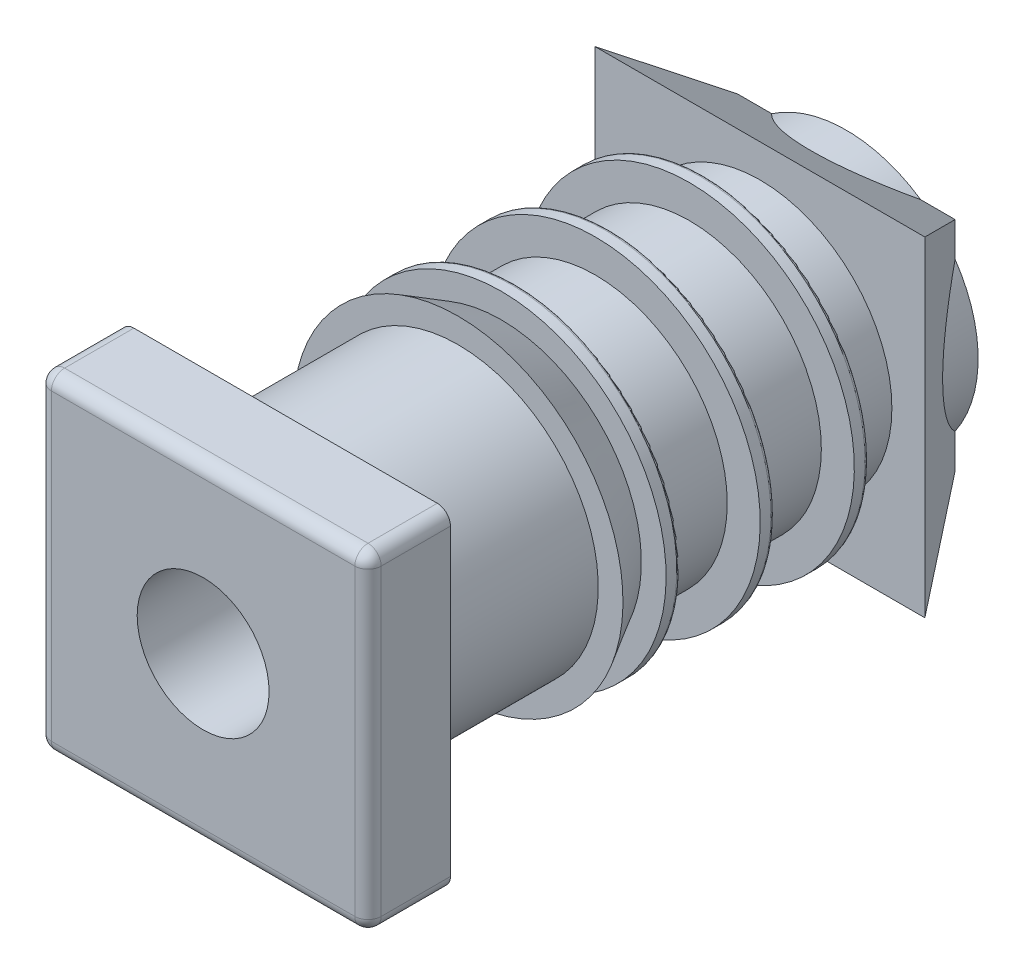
ISO-10303-21;
HEADER;
FILE_DESCRIPTION(('STEP AP214'),'2;1');
FILE_NAME('part.step','',(''),(''),'','','');
FILE_SCHEMA(('AUTOMOTIVE_DESIGN { 1 0 10303 214 1 1 1 1 }'));
ENDSEC;
DATA;
#1=APPLICATION_CONTEXT('core data for automotive mechanical design processes');
#2=APPLICATION_PROTOCOL_DEFINITION('international standard','automotive_design',2000,#1);
#3=PRODUCT_CONTEXT('',#1,'mechanical');
#4=PRODUCT('Part','Part','',(#3));
#5=PRODUCT_RELATED_PRODUCT_CATEGORY('part','',(#4));
#6=PRODUCT_DEFINITION_FORMATION('','',#4);
#7=PRODUCT_DEFINITION_CONTEXT('part definition',#1,'design');
#8=PRODUCT_DEFINITION('design','',#6,#7);
#9=PRODUCT_DEFINITION_SHAPE('','',#8);
#10=(LENGTH_UNIT() NAMED_UNIT(*) SI_UNIT(.MILLI.,.METRE.));
#11=(NAMED_UNIT(*) PLANE_ANGLE_UNIT() SI_UNIT($,.RADIAN.));
#12=(NAMED_UNIT(*) SI_UNIT($,.STERADIAN.) SOLID_ANGLE_UNIT());
#13=UNCERTAINTY_MEASURE_WITH_UNIT(LENGTH_MEASURE(1.E-05),#10,'distance_accuracy_value','');
#14=(GEOMETRIC_REPRESENTATION_CONTEXT(3) GLOBAL_UNCERTAINTY_ASSIGNED_CONTEXT((#13)) GLOBAL_UNIT_ASSIGNED_CONTEXT((#10,
#11,#12)) REPRESENTATION_CONTEXT('',''));
#15=CARTESIAN_POINT('',(0.,0.,0.));
#16=DIRECTION('',(0.,0.,1.));
#17=DIRECTION('',(1.,0.,0.));
#18=AXIS2_PLACEMENT_3D('',#15,#16,#17);
#19=CARTESIAN_POINT('',(-8.9,0.,-13.9269230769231));
#20=DIRECTION('',(0.,0.,-1.));
#21=DIRECTION('',(0.,-1.,0.));
#22=AXIS2_PLACEMENT_3D('',#19,#20,#21);
#23=PLANE('',#22);
#24=CARTESIAN_POINT('',(0.,0.,-13.9269230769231));
#25=DIRECTION('',(0.,0.,1.));
#26=DIRECTION('',(0.,-1.,0.));
#27=AXIS2_PLACEMENT_3D('',#24,#25,#26);
#28=CIRCLE('',#27,9.8);
#29=CARTESIAN_POINT('',(0.,-9.8,-13.9269230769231));
#30=VERTEX_POINT('',#29);
#31=CARTESIAN_POINT('',(0.,9.8,-13.9269230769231));
#32=VERTEX_POINT('',#31);
#33=EDGE_CURVE('E337',#30,#32,#28,.T.);
#34=ORIENTED_EDGE('',*,*,#33,.F.);
#35=CARTESIAN_POINT('',(0.,0.,-13.9269230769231));
#36=DIRECTION('',(0.,0.,1.));
#37=DIRECTION('',(-1.,0.,0.));
#38=AXIS2_PLACEMENT_3D('',#35,#36,#37);
#39=CIRCLE('',#38,9.8);
#40=CARTESIAN_POINT('',(-9.8,0.,-13.9269230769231));
#41=VERTEX_POINT('',#40);
#42=EDGE_CURVE('E347',#41,#30,#39,.T.);
#43=ORIENTED_EDGE('',*,*,#42,.F.);
#44=CARTESIAN_POINT('',(0.,0.,-13.9269230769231));
#45=DIRECTION('',(0.,0.,1.));
#46=DIRECTION('',(0.,1.,0.));
#47=AXIS2_PLACEMENT_3D('',#44,#45,#46);
#48=CIRCLE('',#47,9.8);
#49=EDGE_CURVE('E296',#32,#41,#48,.T.);
#50=ORIENTED_EDGE('',*,*,#49,.F.);
#51=EDGE_LOOP('',(#34,#43,#50));
#52=FACE_BOUND('',#51,.T.);
#53=CARTESIAN_POINT('',(0.,0.,-13.9269230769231));
#54=DIRECTION('',(0.,0.,1.));
#55=DIRECTION('',(0.,1.,0.));
#56=AXIS2_PLACEMENT_3D('',#53,#54,#55);
#57=CIRCLE('',#56,8.);
#58=CARTESIAN_POINT('',(0.,8.,-13.9269230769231));
#59=VERTEX_POINT('',#58);
#60=EDGE_CURVE('E435',#59,#59,#57,.F.);
#61=ORIENTED_EDGE('',*,*,#60,.F.);
#62=EDGE_LOOP('',(#61));
#63=FACE_BOUND('',#62,.T.);
#64=ADVANCED_FACE('F14',(#52,#63),#23,.T.);
#65=CARTESIAN_POINT('',(0.,0.,-13.7269230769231));
#66=DIRECTION('',(0.,0.,-1.));
#67=DIRECTION('',(0.,-1.,0.));
#68=AXIS2_PLACEMENT_3D('',#65,#66,#67);
#69=TOROIDAL_SURFACE('',#68,9.8,0.2);
#70=ORIENTED_EDGE('',*,*,#42,.T.);
#71=ORIENTED_EDGE('',*,*,#33,.T.);
#72=ORIENTED_EDGE('',*,*,#49,.T.);
#73=EDGE_LOOP('',(#70,#71,#72));
#74=FACE_BOUND('',#73,.T.);
#75=CARTESIAN_POINT('',(0.,0.,-13.7269230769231));
#76=DIRECTION('',(0.,0.,1.));
#77=DIRECTION('',(0.,1.,0.));
#78=AXIS2_PLACEMENT_3D('',#75,#76,#77);
#79=CIRCLE('',#78,10.);
#80=CARTESIAN_POINT('',(0.,10.,-13.7269230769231));
#81=VERTEX_POINT('',#80);
#82=EDGE_CURVE('E323',#81,#81,#79,.T.);
#83=ORIENTED_EDGE('',*,*,#82,.F.);
#84=EDGE_LOOP('',(#83));
#85=FACE_BOUND('',#84,.T.);
#86=ADVANCED_FACE('F303',(#74,#85),#69,.T.);
#87=CARTESIAN_POINT('',(0.,0.,-16.3554945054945));
#88=DIRECTION('',(0.,0.,1.));
#89=DIRECTION('',(0.,1.,0.));
#90=AXIS2_PLACEMENT_3D('',#87,#88,#89);
#91=CYLINDRICAL_SURFACE('',#90,8.);
#92=CARTESIAN_POINT('',(0.,0.,-18.7840659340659));
#93=DIRECTION('',(0.,0.,1.));
#94=DIRECTION('',(0.,1.,0.));
#95=AXIS2_PLACEMENT_3D('',#92,#93,#94);
#96=CIRCLE('',#95,8.);
#97=CARTESIAN_POINT('',(0.,8.,-18.7840659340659));
#98=VERTEX_POINT('',#97);
#99=EDGE_CURVE('E432',#98,#98,#96,.F.);
#100=ORIENTED_EDGE('',*,*,#99,.F.);
#101=EDGE_LOOP('',(#100));
#102=FACE_BOUND('',#101,.T.);
#103=ORIENTED_EDGE('',*,*,#60,.T.);
#104=EDGE_LOOP('',(#103));
#105=FACE_BOUND('',#104,.T.);
#106=ADVANCED_FACE('F314',(#102,#105),#91,.T.);
#107=CARTESIAN_POINT('',(0.,0.,-13.4019230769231));
#108=DIRECTION('',(0.,0.,1.));
#109=DIRECTION('',(0.,1.,0.));
#110=AXIS2_PLACEMENT_3D('',#107,#108,#109);
#111=CYLINDRICAL_SURFACE('',#110,10.);
#112=ORIENTED_EDGE('',*,*,#82,.T.);
#113=EDGE_LOOP('',(#112));
#114=FACE_BOUND('',#113,.T.);
#115=CARTESIAN_POINT('',(0.,0.,-13.0769230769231));
#116=DIRECTION('',(0.,0.,1.));
#117=DIRECTION('',(0.,1.,0.));
#118=AXIS2_PLACEMENT_3D('',#115,#116,#117);
#119=CIRCLE('',#118,10.);
#120=CARTESIAN_POINT('',(0.,10.,-13.0769230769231));
#121=VERTEX_POINT('',#120);
#122=EDGE_CURVE('E429',#121,#121,#119,.T.);
#123=ORIENTED_EDGE('',*,*,#122,.F.);
#124=EDGE_LOOP('',(#123));
#125=FACE_BOUND('',#124,.T.);
#126=ADVANCED_FACE('F1013',(#114,#125),#111,.T.);
#127=CARTESIAN_POINT('',(-9.,0.,-18.7840659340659));
#128=DIRECTION('',(0.,0.,1.));
#129=DIRECTION('',(0.,1.,0.));
#130=AXIS2_PLACEMENT_3D('',#127,#128,#129);
#131=PLANE('',#130);
#132=ORIENTED_EDGE('',*,*,#99,.T.);
#133=EDGE_LOOP('',(#132));
#134=FACE_BOUND('',#133,.T.);
#135=CARTESIAN_POINT('',(0.,0.,-18.7840659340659));
#136=DIRECTION('',(0.,0.,1.));
#137=DIRECTION('',(0.,1.,0.));
#138=AXIS2_PLACEMENT_3D('',#135,#136,#137);
#139=CIRCLE('',#138,10.);
#140=CARTESIAN_POINT('',(0.,10.,-18.7840659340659));
#141=VERTEX_POINT('',#140);
#142=EDGE_CURVE('E426',#141,#141,#139,.F.);
#143=ORIENTED_EDGE('',*,*,#142,.F.);
#144=EDGE_LOOP('',(#143));
#145=FACE_BOUND('',#144,.T.);
#146=ADVANCED_FACE('F1003',(#134,#145),#131,.T.);
#147=CARTESIAN_POINT('',(-9.25,0.,-13.0769230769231));
#148=DIRECTION('',(0.,0.,1.));
#149=DIRECTION('',(0.,1.,0.));
#150=AXIS2_PLACEMENT_3D('',#147,#148,#149);
#151=PLANE('',#150);
#152=CARTESIAN_POINT('',(0.,0.,-13.0769230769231));
#153=DIRECTION('',(0.,0.,1.));
#154=DIRECTION('',(0.,1.,0.));
#155=AXIS2_PLACEMENT_3D('',#152,#153,#154);
#156=CIRCLE('',#155,8.5);
#157=CARTESIAN_POINT('',(0.,8.5,-13.0769230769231));
#158=VERTEX_POINT('',#157);
#159=EDGE_CURVE('E423',#158,#158,#156,.T.);
#160=ORIENTED_EDGE('',*,*,#159,.F.);
#161=EDGE_LOOP('',(#160));
#162=FACE_BOUND('',#161,.T.);
#163=ORIENTED_EDGE('',*,*,#122,.T.);
#164=EDGE_LOOP('',(#163));
#165=FACE_BOUND('',#164,.T.);
#166=ADVANCED_FACE('F994',(#162,#165),#151,.T.);
#167=CARTESIAN_POINT('',(0.,0.,-19.1090659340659));
#168=DIRECTION('',(0.,0.,1.));
#169=DIRECTION('',(0.,1.,0.));
#170=AXIS2_PLACEMENT_3D('',#167,#168,#169);
#171=CYLINDRICAL_SURFACE('',#170,10.);
#172=ORIENTED_EDGE('',*,*,#142,.T.);
#173=EDGE_LOOP('',(#172));
#174=FACE_BOUND('',#173,.T.);
#175=CARTESIAN_POINT('',(0.,0.,-19.4340659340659));
#176=DIRECTION('',(0.,0.,-1.));
#177=DIRECTION('',(0.,-1.,0.));
#178=AXIS2_PLACEMENT_3D('',#175,#176,#177);
#179=CIRCLE('',#178,10.);
#180=CARTESIAN_POINT('',(0.,-10.,-19.4340659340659));
#181=VERTEX_POINT('',#180);
#182=EDGE_CURVE('E263',#181,#181,#179,.T.);
#183=ORIENTED_EDGE('',*,*,#182,.F.);
#184=EDGE_LOOP('',(#183));
#185=FACE_BOUND('',#184,.T.);
#186=ADVANCED_FACE('F985',(#174,#185),#171,.T.);
#187=CARTESIAN_POINT('',(0.,0.,-10.4615384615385));
#188=DIRECTION('',(0.,0.,1.));
#189=DIRECTION('',(0.,1.,0.));
#190=AXIS2_PLACEMENT_3D('',#187,#188,#189);
#191=CONICAL_SURFACE('',#190,10.,0.520728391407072);
#192=ORIENTED_EDGE('',*,*,#159,.T.);
#193=EDGE_LOOP('',(#192));
#194=FACE_BOUND('',#193,.T.);
#195=CARTESIAN_POINT('',(0.,0.,-10.4615384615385));
#196=DIRECTION('',(0.,0.,1.));
#197=DIRECTION('',(0.,1.,0.));
#198=AXIS2_PLACEMENT_3D('',#195,#196,#197);
#199=CIRCLE('',#198,10.);
#200=CARTESIAN_POINT('',(0.,10.,-10.4615384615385));
#201=VERTEX_POINT('',#200);
#202=EDGE_CURVE('E255',#201,#201,#199,.T.);
#203=ORIENTED_EDGE('',*,*,#202,.F.);
#204=EDGE_LOOP('',(#203));
#205=FACE_BOUND('',#204,.T.);
#206=ADVANCED_FACE('F273',(#194,#205),#191,.T.);
#207=CARTESIAN_POINT('',(0.,0.,-19.4340659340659));
#208=DIRECTION('',(0.,0.,-1.));
#209=DIRECTION('',(0.,-1.,0.));
#210=AXIS2_PLACEMENT_3D('',#207,#208,#209);
#211=TOROIDAL_SURFACE('',#210,9.8,0.2);
#212=ORIENTED_EDGE('',*,*,#182,.T.);
#213=EDGE_LOOP('',(#212));
#214=FACE_BOUND('',#213,.T.);
#215=CARTESIAN_POINT('',(0.,0.,-19.6340659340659));
#216=DIRECTION('',(0.,0.,1.));
#217=DIRECTION('',(0.,1.,0.));
#218=AXIS2_PLACEMENT_3D('',#215,#216,#217);
#219=CIRCLE('',#218,9.8);
#220=CARTESIAN_POINT('',(-9.8,0.,-19.6340659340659));
#221=VERTEX_POINT('',#220);
#222=CARTESIAN_POINT('',(0.,9.8,-19.6340659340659));
#223=VERTEX_POINT('',#222);
#224=EDGE_CURVE('E207',#221,#223,#219,.F.);
#225=ORIENTED_EDGE('',*,*,#224,.F.);
#226=CARTESIAN_POINT('',(0.,0.,-19.6340659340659));
#227=DIRECTION('',(0.,0.,1.));
#228=DIRECTION('',(-1.,0.,0.));
#229=AXIS2_PLACEMENT_3D('',#226,#227,#228);
#230=CIRCLE('',#229,9.8);
#231=CARTESIAN_POINT('',(0.,-9.8,-19.6340659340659));
#232=VERTEX_POINT('',#231);
#233=EDGE_CURVE('E244',#232,#221,#230,.F.);
#234=ORIENTED_EDGE('',*,*,#233,.F.);
#235=CARTESIAN_POINT('',(0.,0.,-19.6340659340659));
#236=DIRECTION('',(0.,0.,1.));
#237=DIRECTION('',(0.,-1.,0.));
#238=AXIS2_PLACEMENT_3D('',#235,#236,#237);
#239=CIRCLE('',#238,9.8);
#240=EDGE_CURVE('E246',#223,#232,#239,.F.);
#241=ORIENTED_EDGE('',*,*,#240,.F.);
#242=EDGE_LOOP('',(#225,#234,#241));
#243=FACE_BOUND('',#242,.T.);
#244=ADVANCED_FACE('F253',(#214,#243),#211,.T.);
#245=CARTESIAN_POINT('',(-9.25,0.,-10.4615384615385));
#246=DIRECTION('',(0.,0.,1.));
#247=DIRECTION('',(0.,1.,0.));
#248=AXIS2_PLACEMENT_3D('',#245,#246,#247);
#249=PLANE('',#248);
#250=CARTESIAN_POINT('',(0.,0.,-10.4615384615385));
#251=DIRECTION('',(0.,0.,1.));
#252=DIRECTION('',(0.,1.,0.));
#253=AXIS2_PLACEMENT_3D('',#250,#251,#252);
#254=CIRCLE('',#253,8.5);
#255=CARTESIAN_POINT('',(0.,8.5,-10.4615384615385));
#256=VERTEX_POINT('',#255);
#257=EDGE_CURVE('E251',#256,#256,#254,.T.);
#258=ORIENTED_EDGE('',*,*,#257,.F.);
#259=EDGE_LOOP('',(#258));
#260=FACE_BOUND('',#259,.T.);
#261=ORIENTED_EDGE('',*,*,#202,.T.);
#262=EDGE_LOOP('',(#261));
#263=FACE_BOUND('',#262,.T.);
#264=ADVANCED_FACE('F225',(#260,#263),#249,.T.);
#265=CARTESIAN_POINT('',(-8.9,0.,-19.6340659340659));
#266=DIRECTION('',(0.,0.,-1.));
#267=DIRECTION('',(0.,-1.,0.));
#268=AXIS2_PLACEMENT_3D('',#265,#266,#267);
#269=PLANE('',#268);
#270=ORIENTED_EDGE('',*,*,#240,.T.);
#271=ORIENTED_EDGE('',*,*,#233,.T.);
#272=ORIENTED_EDGE('',*,*,#224,.T.);
#273=EDGE_LOOP('',(#270,#271,#272));
#274=FACE_BOUND('',#273,.T.);
#275=CARTESIAN_POINT('',(0.,0.,-19.6340659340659));
#276=DIRECTION('',(0.,0.,1.));
#277=DIRECTION('',(0.,1.,0.));
#278=AXIS2_PLACEMENT_3D('',#275,#276,#277);
#279=CIRCLE('',#278,8.);
#280=CARTESIAN_POINT('',(0.,8.,-19.6340659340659));
#281=VERTEX_POINT('',#280);
#282=EDGE_CURVE('E416',#281,#281,#279,.F.);
#283=ORIENTED_EDGE('',*,*,#282,.F.);
#284=EDGE_LOOP('',(#283));
#285=FACE_BOUND('',#284,.T.);
#286=ADVANCED_FACE('F214',(#274,#285),#269,.T.);
#287=CARTESIAN_POINT('',(0.,0.,-2.73076923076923));
#288=DIRECTION('',(0.,0.,1.));
#289=DIRECTION('',(0.,1.,0.));
#290=AXIS2_PLACEMENT_3D('',#287,#288,#289);
#291=CYLINDRICAL_SURFACE('',#290,8.5);
#292=CARTESIAN_POINT('',(0.,0.,0.));
#293=DIRECTION('',(0.,0.,1.));
#294=DIRECTION('',(0.,1.,0.));
#295=AXIS2_PLACEMENT_3D('',#292,#293,#294);
#296=CIRCLE('',#295,8.5);
#297=CARTESIAN_POINT('',(0.,8.5,0.));
#298=VERTEX_POINT('',#297);
#299=EDGE_CURVE('E407',#298,#298,#296,.T.);
#300=ORIENTED_EDGE('',*,*,#299,.F.);
#301=EDGE_LOOP('',(#300));
#302=FACE_BOUND('',#301,.T.);
#303=ORIENTED_EDGE('',*,*,#257,.T.);
#304=EDGE_LOOP('',(#303));
#305=FACE_BOUND('',#304,.T.);
#306=ADVANCED_FACE('F224',(#302,#305),#291,.T.);
#307=CARTESIAN_POINT('',(0.,0.,-22.0626373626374));
#308=DIRECTION('',(0.,0.,1.));
#309=DIRECTION('',(0.,1.,0.));
#310=AXIS2_PLACEMENT_3D('',#307,#308,#309);
#311=CYLINDRICAL_SURFACE('',#310,8.);
#312=CARTESIAN_POINT('',(0.,0.,-24.4912087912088));
#313=DIRECTION('',(0.,0.,1.));
#314=DIRECTION('',(0.,1.,0.));
#315=AXIS2_PLACEMENT_3D('',#312,#313,#314);
#316=CIRCLE('',#315,8.);
#317=CARTESIAN_POINT('',(0.,8.,-24.4912087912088));
#318=VERTEX_POINT('',#317);
#319=EDGE_CURVE('E192',#318,#318,#316,.F.);
#320=ORIENTED_EDGE('',*,*,#319,.F.);
#321=EDGE_LOOP('',(#320));
#322=FACE_BOUND('',#321,.T.);
#323=ORIENTED_EDGE('',*,*,#282,.T.);
#324=EDGE_LOOP('',(#323));
#325=FACE_BOUND('',#324,.T.);
#326=ADVANCED_FACE('F883',(#322,#325),#311,.T.);
#327=CARTESIAN_POINT('',(9.2,-9.2,5.));
#328=DIRECTION('',(0.,0.,1.));
#329=DIRECTION('',(0.,1.,0.));
#330=AXIS2_PLACEMENT_3D('',#327,#328,#329);
#331=CYLINDRICAL_SURFACE('',#330,0.8);
#332=DIRECTION('',(0.,0.,-1.));
#333=VECTOR('',#332,1.);
#334=CARTESIAN_POINT('',(10.,-9.2,5.));
#335=LINE('',#334,#333);
#336=CARTESIAN_POINT('',(10.,-9.2,4.2));
#337=VERTEX_POINT('',#336);
#338=CARTESIAN_POINT('',(10.,-9.2,0.));
#339=VERTEX_POINT('',#338);
#340=EDGE_CURVE('E143',#337,#339,#335,.T.);
#341=ORIENTED_EDGE('',*,*,#340,.F.);
#342=CARTESIAN_POINT('',(9.2,-9.2,4.2));
#343=DIRECTION('',(0.,0.,1.));
#344=DIRECTION('',(1.,0.,0.));
#345=AXIS2_PLACEMENT_3D('',#342,#343,#344);
#346=CIRCLE('',#345,0.8);
#347=CARTESIAN_POINT('',(9.2,-10.,4.2));
#348=VERTEX_POINT('',#347);
#349=EDGE_CURVE('E129',#337,#348,#346,.F.);
#350=ORIENTED_EDGE('',*,*,#349,.T.);
#351=DIRECTION('',(0.,0.,-1.));
#352=VECTOR('',#351,1.);
#353=CARTESIAN_POINT('',(9.2,-10.,5.));
#354=LINE('',#353,#352);
#355=CARTESIAN_POINT('',(9.2,-10.,0.));
#356=VERTEX_POINT('',#355);
#357=EDGE_CURVE('E142',#356,#348,#354,.F.);
#358=ORIENTED_EDGE('',*,*,#357,.F.);
#359=CARTESIAN_POINT('',(9.2,-9.2,0.));
#360=DIRECTION('',(0.,0.,1.));
#361=DIRECTION('',(0.,1.,0.));
#362=AXIS2_PLACEMENT_3D('',#359,#360,#361);
#363=CIRCLE('',#362,0.8);
#364=EDGE_CURVE('E412',#339,#356,#363,.F.);
#365=ORIENTED_EDGE('',*,*,#364,.F.);
#366=EDGE_LOOP('',(#341,#350,#358,#365));
#367=FACE_BOUND('',#366,.T.);
#368=ADVANCED_FACE('F140',(#367),#331,.T.);
#369=CARTESIAN_POINT('',(9.2,9.2,5.));
#370=DIRECTION('',(0.,0.,1.));
#371=DIRECTION('',(0.,1.,0.));
#372=AXIS2_PLACEMENT_3D('',#369,#370,#371);
#373=CYLINDRICAL_SURFACE('',#372,0.8);
#374=DIRECTION('',(0.,0.,-1.));
#375=VECTOR('',#374,1.);
#376=CARTESIAN_POINT('',(9.2,10.,5.));
#377=LINE('',#376,#375);
#378=CARTESIAN_POINT('',(9.2,10.,4.2));
#379=VERTEX_POINT('',#378);
#380=CARTESIAN_POINT('',(9.2,10.,0.));
#381=VERTEX_POINT('',#380);
#382=EDGE_CURVE('E181',#379,#381,#377,.T.);
#383=ORIENTED_EDGE('',*,*,#382,.F.);
#384=CARTESIAN_POINT('',(9.2,9.2,4.2));
#385=DIRECTION('',(0.,0.,1.));
#386=DIRECTION('',(1.,0.,0.));
#387=AXIS2_PLACEMENT_3D('',#384,#385,#386);
#388=CIRCLE('',#387,0.8);
#389=CARTESIAN_POINT('',(10.,9.2,4.2));
#390=VERTEX_POINT('',#389);
#391=EDGE_CURVE('E9',#379,#390,#388,.F.);
#392=ORIENTED_EDGE('',*,*,#391,.T.);
#393=DIRECTION('',(0.,0.,-1.));
#394=VECTOR('',#393,1.);
#395=CARTESIAN_POINT('',(10.,9.2,5.));
#396=LINE('',#395,#394);
#397=CARTESIAN_POINT('',(10.,9.2,0.));
#398=VERTEX_POINT('',#397);
#399=EDGE_CURVE('E184',#398,#390,#396,.F.);
#400=ORIENTED_EDGE('',*,*,#399,.F.);
#401=CARTESIAN_POINT('',(9.2,9.2,0.));
#402=DIRECTION('',(0.,0.,1.));
#403=DIRECTION('',(0.,1.,0.));
#404=AXIS2_PLACEMENT_3D('',#401,#402,#403);
#405=CIRCLE('',#404,0.8);
#406=EDGE_CURVE('E414',#381,#398,#405,.F.);
#407=ORIENTED_EDGE('',*,*,#406,.F.);
#408=EDGE_LOOP('',(#383,#392,#400,#407));
#409=FACE_BOUND('',#408,.T.);
#410=ADVANCED_FACE('F545',(#409),#373,.T.);
#411=CARTESIAN_POINT('',(-9.2,9.2,5.));
#412=DIRECTION('',(0.,0.,1.));
#413=DIRECTION('',(0.,1.,0.));
#414=AXIS2_PLACEMENT_3D('',#411,#412,#413);
#415=CYLINDRICAL_SURFACE('',#414,0.8);
#416=DIRECTION('',(0.,0.,-1.));
#417=VECTOR('',#416,1.);
#418=CARTESIAN_POINT('',(-10.,9.2,5.));
#419=LINE('',#418,#417);
#420=CARTESIAN_POINT('',(-10.,9.2,4.2));
#421=VERTEX_POINT('',#420);
#422=CARTESIAN_POINT('',(-10.,9.2,0.));
#423=VERTEX_POINT('',#422);
#424=EDGE_CURVE('E175',#421,#423,#419,.T.);
#425=ORIENTED_EDGE('',*,*,#424,.F.);
#426=CARTESIAN_POINT('',(-9.2,9.2,4.2));
#427=DIRECTION('',(0.,0.,1.));
#428=DIRECTION('',(1.,0.,0.));
#429=AXIS2_PLACEMENT_3D('',#426,#427,#428);
#430=CIRCLE('',#429,0.8);
#431=CARTESIAN_POINT('',(-9.2,10.,4.2));
#432=VERTEX_POINT('',#431);
#433=EDGE_CURVE('E517',#421,#432,#430,.F.);
#434=ORIENTED_EDGE('',*,*,#433,.T.);
#435=DIRECTION('',(0.,0.,-1.));
#436=VECTOR('',#435,1.);
#437=CARTESIAN_POINT('',(-9.2,10.,5.));
#438=LINE('',#437,#436);
#439=CARTESIAN_POINT('',(-9.2,10.,0.));
#440=VERTEX_POINT('',#439);
#441=EDGE_CURVE('E178',#440,#432,#438,.F.);
#442=ORIENTED_EDGE('',*,*,#441,.F.);
#443=CARTESIAN_POINT('',(-9.2,9.2,0.));
#444=DIRECTION('',(0.,0.,1.));
#445=DIRECTION('',(0.,1.,0.));
#446=AXIS2_PLACEMENT_3D('',#443,#444,#445);
#447=CIRCLE('',#446,0.8);
#448=EDGE_CURVE('E410',#423,#440,#447,.F.);
#449=ORIENTED_EDGE('',*,*,#448,.F.);
#450=EDGE_LOOP('',(#425,#434,#442,#449));
#451=FACE_BOUND('',#450,.T.);
#452=ADVANCED_FACE('F554',(#451),#415,.T.);
#453=CARTESIAN_POINT('',(0.,0.,0.));
#454=DIRECTION('',(0.,0.,-1.));
#455=DIRECTION('',(0.,-1.,0.));
#456=AXIS2_PLACEMENT_3D('',#453,#454,#455);
#457=PLANE('',#456);
#458=ORIENTED_EDGE('',*,*,#299,.T.);
#459=EDGE_LOOP('',(#458));
#460=FACE_BOUND('',#459,.T.);
#461=ORIENTED_EDGE('',*,*,#448,.T.);
#462=DIRECTION('',(1.,0.,0.));
#463=VECTOR('',#462,1.);
#464=CARTESIAN_POINT('',(9.2,10.,0.));
#465=LINE('',#464,#463);
#466=EDGE_CURVE('E183',#381,#440,#465,.F.);
#467=ORIENTED_EDGE('',*,*,#466,.F.);
#468=ORIENTED_EDGE('',*,*,#406,.T.);
#469=DIRECTION('',(0.,-1.,0.));
#470=VECTOR('',#469,1.);
#471=CARTESIAN_POINT('',(10.,-9.2,0.));
#472=LINE('',#471,#470);
#473=EDGE_CURVE('E188',#339,#398,#472,.F.);
#474=ORIENTED_EDGE('',*,*,#473,.F.);
#475=ORIENTED_EDGE('',*,*,#364,.T.);
#476=DIRECTION('',(-1.,0.,0.));
#477=VECTOR('',#476,1.);
#478=CARTESIAN_POINT('',(-9.2,-10.,0.));
#479=LINE('',#478,#477);
#480=CARTESIAN_POINT('',(-9.2,-10.,0.));
#481=VERTEX_POINT('',#480);
#482=EDGE_CURVE('E155',#481,#356,#479,.F.);
#483=ORIENTED_EDGE('',*,*,#482,.F.);
#484=CARTESIAN_POINT('',(-9.2,-9.2,0.));
#485=DIRECTION('',(0.,0.,1.));
#486=DIRECTION('',(0.,1.,0.));
#487=AXIS2_PLACEMENT_3D('',#484,#485,#486);
#488=CIRCLE('',#487,0.8);
#489=CARTESIAN_POINT('',(-10.,-9.2,0.));
#490=VERTEX_POINT('',#489);
#491=EDGE_CURVE('E405',#490,#481,#488,.T.);
#492=ORIENTED_EDGE('',*,*,#491,.F.);
#493=DIRECTION('',(0.,1.,0.));
#494=VECTOR('',#493,1.);
#495=CARTESIAN_POINT('',(-10.,9.2,0.));
#496=LINE('',#495,#494);
#497=EDGE_CURVE('E177',#423,#490,#496,.F.);
#498=ORIENTED_EDGE('',*,*,#497,.F.);
#499=EDGE_LOOP('',(#461,#467,#468,#474,#475,#483,#492,#498));
#500=FACE_BOUND('',#499,.T.);
#501=ADVANCED_FACE('F571',(#460,#500),#457,.T.);
#502=CARTESIAN_POINT('',(-9.2,-9.2,5.));
#503=DIRECTION('',(0.,0.,1.));
#504=DIRECTION('',(0.,1.,0.));
#505=AXIS2_PLACEMENT_3D('',#502,#503,#504);
#506=CYLINDRICAL_SURFACE('',#505,0.8);
#507=DIRECTION('',(0.,0.,-1.));
#508=VECTOR('',#507,1.);
#509=CARTESIAN_POINT('',(-9.2,-10.,5.));
#510=LINE('',#509,#508);
#511=CARTESIAN_POINT('',(-9.2,-10.,4.2));
#512=VERTEX_POINT('',#511);
#513=EDGE_CURVE('E191',#512,#481,#510,.T.);
#514=ORIENTED_EDGE('',*,*,#513,.F.);
#515=CARTESIAN_POINT('',(-9.2,-9.2,4.2));
#516=DIRECTION('',(0.,0.,1.));
#517=DIRECTION('',(1.,0.,0.));
#518=AXIS2_PLACEMENT_3D('',#515,#516,#517);
#519=CIRCLE('',#518,0.8);
#520=CARTESIAN_POINT('',(-10.,-9.2,4.2));
#521=VERTEX_POINT('',#520);
#522=EDGE_CURVE('E526',#512,#521,#519,.F.);
#523=ORIENTED_EDGE('',*,*,#522,.T.);
#524=DIRECTION('',(0.,0.,-1.));
#525=VECTOR('',#524,1.);
#526=CARTESIAN_POINT('',(-10.,-9.2,5.));
#527=LINE('',#526,#525);
#528=EDGE_CURVE('E166',#490,#521,#527,.F.);
#529=ORIENTED_EDGE('',*,*,#528,.F.);
#530=ORIENTED_EDGE('',*,*,#491,.T.);
#531=EDGE_LOOP('',(#514,#523,#529,#530));
#532=FACE_BOUND('',#531,.T.);
#533=ADVANCED_FACE('F566',(#532),#506,.T.);
#534=CARTESIAN_POINT('',(-9.,0.,-24.4912087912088));
#535=DIRECTION('',(0.,0.,1.));
#536=DIRECTION('',(0.,1.,0.));
#537=AXIS2_PLACEMENT_3D('',#534,#535,#536);
#538=PLANE('',#537);
#539=ORIENTED_EDGE('',*,*,#319,.T.);
#540=EDGE_LOOP('',(#539));
#541=FACE_BOUND('',#540,.T.);
#542=CARTESIAN_POINT('',(0.,0.,-24.4912087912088));
#543=DIRECTION('',(0.,0.,1.));
#544=DIRECTION('',(0.,1.,0.));
#545=AXIS2_PLACEMENT_3D('',#542,#543,#544);
#546=CIRCLE('',#545,10.);
#547=CARTESIAN_POINT('',(0.,10.,-24.4912087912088));
#548=VERTEX_POINT('',#547);
#549=EDGE_CURVE('E161',#548,#548,#546,.F.);
#550=ORIENTED_EDGE('',*,*,#549,.F.);
#551=EDGE_LOOP('',(#550));
#552=FACE_BOUND('',#551,.T.);
#553=ADVANCED_FACE('F581',(#541,#552),#538,.T.);
#554=CARTESIAN_POINT('',(-9.2,-10.,5.));
#555=DIRECTION('',(0.,-1.,0.));
#556=DIRECTION('',(-1.,0.,0.));
#557=AXIS2_PLACEMENT_3D('',#554,#555,#556);
#558=PLANE('',#557);
#559=ORIENTED_EDGE('',*,*,#482,.T.);
#560=ORIENTED_EDGE('',*,*,#357,.T.);
#561=DIRECTION('',(-1.,0.,0.));
#562=VECTOR('',#561,1.);
#563=CARTESIAN_POINT('',(-20.,-10.,4.2));
#564=LINE('',#563,#562);
#565=EDGE_CURVE('E152',#512,#348,#564,.F.);
#566=ORIENTED_EDGE('',*,*,#565,.F.);
#567=ORIENTED_EDGE('',*,*,#513,.T.);
#568=EDGE_LOOP('',(#559,#560,#566,#567));
#569=FACE_BOUND('',#568,.T.);
#570=ADVANCED_FACE('F150',(#569),#558,.T.);
#571=CARTESIAN_POINT('',(10.,-9.2,5.));
#572=DIRECTION('',(1.,0.,0.));
#573=DIRECTION('',(0.,-1.,0.));
#574=AXIS2_PLACEMENT_3D('',#571,#572,#573);
#575=PLANE('',#574);
#576=ORIENTED_EDGE('',*,*,#473,.T.);
#577=ORIENTED_EDGE('',*,*,#399,.T.);
#578=DIRECTION('',(0.,-1.,0.));
#579=VECTOR('',#578,1.);
#580=CARTESIAN_POINT('',(10.,-20.,4.2));
#581=LINE('',#580,#579);
#582=EDGE_CURVE('E160',#337,#390,#581,.F.);
#583=ORIENTED_EDGE('',*,*,#582,.F.);
#584=ORIENTED_EDGE('',*,*,#340,.T.);
#585=EDGE_LOOP('',(#576,#577,#583,#584));
#586=FACE_BOUND('',#585,.T.);
#587=ADVANCED_FACE('F540',(#586),#575,.T.);
#588=CARTESIAN_POINT('',(9.2,10.,5.));
#589=DIRECTION('',(0.,1.,0.));
#590=DIRECTION('',(1.,0.,0.));
#591=AXIS2_PLACEMENT_3D('',#588,#589,#590);
#592=PLANE('',#591);
#593=ORIENTED_EDGE('',*,*,#466,.T.);
#594=ORIENTED_EDGE('',*,*,#441,.T.);
#595=DIRECTION('',(-1.,0.,0.));
#596=VECTOR('',#595,1.);
#597=CARTESIAN_POINT('',(-20.,10.,4.2));
#598=LINE('',#597,#596);
#599=EDGE_CURVE('E163',#379,#432,#598,.T.);
#600=ORIENTED_EDGE('',*,*,#599,.F.);
#601=ORIENTED_EDGE('',*,*,#382,.T.);
#602=EDGE_LOOP('',(#593,#594,#600,#601));
#603=FACE_BOUND('',#602,.T.);
#604=ADVANCED_FACE('F549',(#603),#592,.T.);
#605=CARTESIAN_POINT('',(-10.,9.2,5.));
#606=DIRECTION('',(-1.,0.,0.));
#607=DIRECTION('',(0.,1.,0.));
#608=AXIS2_PLACEMENT_3D('',#605,#606,#607);
#609=PLANE('',#608);
#610=ORIENTED_EDGE('',*,*,#497,.T.);
#611=ORIENTED_EDGE('',*,*,#528,.T.);
#612=DIRECTION('',(0.,-1.,0.));
#613=VECTOR('',#612,1.);
#614=CARTESIAN_POINT('',(-10.,-20.,4.2));
#615=LINE('',#614,#613);
#616=EDGE_CURVE('E174',#421,#521,#615,.T.);
#617=ORIENTED_EDGE('',*,*,#616,.F.);
#618=ORIENTED_EDGE('',*,*,#424,.T.);
#619=EDGE_LOOP('',(#610,#611,#617,#618));
#620=FACE_BOUND('',#619,.T.);
#621=ADVANCED_FACE('F568',(#620),#609,.T.);
#622=CARTESIAN_POINT('',(0.,0.,-24.8162087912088));
#623=DIRECTION('',(0.,0.,1.));
#624=DIRECTION('',(0.,1.,0.));
#625=AXIS2_PLACEMENT_3D('',#622,#623,#624);
#626=CYLINDRICAL_SURFACE('',#625,10.);
#627=ORIENTED_EDGE('',*,*,#549,.T.);
#628=EDGE_LOOP('',(#627));
#629=FACE_BOUND('',#628,.T.);
#630=CARTESIAN_POINT('',(0.,0.,-25.1412087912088));
#631=DIRECTION('',(0.,0.,-1.));
#632=DIRECTION('',(0.,-1.,0.));
#633=AXIS2_PLACEMENT_3D('',#630,#631,#632);
#634=CIRCLE('',#633,10.);
#635=CARTESIAN_POINT('',(0.,-10.,-25.1412087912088));
#636=VERTEX_POINT('',#635);
#637=EDGE_CURVE('E170',#636,#636,#634,.T.);
#638=ORIENTED_EDGE('',*,*,#637,.F.);
#639=EDGE_LOOP('',(#638));
#640=FACE_BOUND('',#639,.T.);
#641=ADVANCED_FACE('F934',(#629,#640),#626,.T.);
#642=CARTESIAN_POINT('',(-20.,-9.2,4.2));
#643=DIRECTION('',(-1.,0.,0.));
#644=DIRECTION('',(0.,1.,0.));
#645=AXIS2_PLACEMENT_3D('',#642,#643,#644);
#646=CYLINDRICAL_SURFACE('',#645,0.8);
#647=ORIENTED_EDGE('',*,*,#565,.T.);
#648=CARTESIAN_POINT('',(9.2,-9.2,4.2));
#649=DIRECTION('',(-1.,0.,0.));
#650=DIRECTION('',(0.,0.,1.));
#651=AXIS2_PLACEMENT_3D('',#648,#649,#650);
#652=CIRCLE('',#651,0.8);
#653=CARTESIAN_POINT('',(9.2,-9.2,5.));
#654=VERTEX_POINT('',#653);
#655=EDGE_CURVE('E126',#348,#654,#652,.T.);
#656=ORIENTED_EDGE('',*,*,#655,.T.);
#657=DIRECTION('',(-1.,0.,0.));
#658=VECTOR('',#657,1.);
#659=CARTESIAN_POINT('',(-4.25,-9.2,5.));
#660=LINE('',#659,#658);
#661=CARTESIAN_POINT('',(-9.2,-9.2,5.));
#662=VERTEX_POINT('',#661);
#663=EDGE_CURVE('E173',#662,#654,#660,.F.);
#664=ORIENTED_EDGE('',*,*,#663,.F.);
#665=CARTESIAN_POINT('',(-9.2,-9.2,4.2));
#666=DIRECTION('',(-1.,0.,0.));
#667=DIRECTION('',(0.,0.,1.));
#668=AXIS2_PLACEMENT_3D('',#665,#666,#667);
#669=CIRCLE('',#668,0.8);
#670=EDGE_CURVE('E135',#662,#512,#669,.F.);
#671=ORIENTED_EDGE('',*,*,#670,.T.);
#672=EDGE_LOOP('',(#647,#656,#664,#671));
#673=FACE_BOUND('',#672,.T.);
#674=ADVANCED_FACE('F157',(#673),#646,.T.);
#675=CARTESIAN_POINT('',(9.2,-20.,4.2));
#676=DIRECTION('',(0.,-1.,0.));
#677=DIRECTION('',(-1.,0.,0.));
#678=AXIS2_PLACEMENT_3D('',#675,#676,#677);
#679=CYLINDRICAL_SURFACE('',#678,0.8);
#680=DIRECTION('',(0.,1.,0.));
#681=VECTOR('',#680,1.);
#682=CARTESIAN_POINT('',(9.2,0.,5.));
#683=LINE('',#682,#681);
#684=CARTESIAN_POINT('',(9.2,9.2,5.));
#685=VERTEX_POINT('',#684);
#686=EDGE_CURVE('E500',#654,#685,#683,.T.);
#687=ORIENTED_EDGE('',*,*,#686,.F.);
#688=CARTESIAN_POINT('',(9.2,-9.2,4.2));
#689=DIRECTION('',(0.,-1.,0.));
#690=DIRECTION('',(0.,0.,-1.));
#691=AXIS2_PLACEMENT_3D('',#688,#689,#690);
#692=CIRCLE('',#691,0.8);
#693=EDGE_CURVE('E121',#654,#337,#692,.F.);
#694=ORIENTED_EDGE('',*,*,#693,.T.);
#695=ORIENTED_EDGE('',*,*,#582,.T.);
#696=CARTESIAN_POINT('',(9.2,9.2,4.2));
#697=DIRECTION('',(0.,-1.,0.));
#698=DIRECTION('',(0.,0.,-1.));
#699=AXIS2_PLACEMENT_3D('',#696,#697,#698);
#700=CIRCLE('',#699,0.8);
#701=EDGE_CURVE('E134',#390,#685,#700,.T.);
#702=ORIENTED_EDGE('',*,*,#701,.T.);
#703=EDGE_LOOP('',(#687,#694,#695,#702));
#704=FACE_BOUND('',#703,.T.);
#705=ADVANCED_FACE('F538',(#704),#679,.T.);
#706=CARTESIAN_POINT('',(-20.,9.2,4.2));
#707=DIRECTION('',(-1.,0.,0.));
#708=DIRECTION('',(0.,1.,0.));
#709=AXIS2_PLACEMENT_3D('',#706,#707,#708);
#710=CYLINDRICAL_SURFACE('',#709,0.8);
#711=ORIENTED_EDGE('',*,*,#599,.T.);
#712=CARTESIAN_POINT('',(-9.2,9.2,4.2));
#713=DIRECTION('',(-1.,0.,0.));
#714=DIRECTION('',(0.,0.,1.));
#715=AXIS2_PLACEMENT_3D('',#712,#713,#714);
#716=CIRCLE('',#715,0.8);
#717=CARTESIAN_POINT('',(-9.2,9.2,5.));
#718=VERTEX_POINT('',#717);
#719=EDGE_CURVE('E23',#432,#718,#716,.F.);
#720=ORIENTED_EDGE('',*,*,#719,.T.);
#721=DIRECTION('',(-1.,0.,0.));
#722=VECTOR('',#721,1.);
#723=CARTESIAN_POINT('',(-4.25,9.2,5.));
#724=LINE('',#723,#722);
#725=EDGE_CURVE('E496',#685,#718,#724,.T.);
#726=ORIENTED_EDGE('',*,*,#725,.F.);
#727=CARTESIAN_POINT('',(9.2,9.2,4.2));
#728=DIRECTION('',(-1.,0.,0.));
#729=DIRECTION('',(0.,0.,1.));
#730=AXIS2_PLACEMENT_3D('',#727,#728,#729);
#731=CIRCLE('',#730,0.8);
#732=EDGE_CURVE('E513',#685,#379,#731,.T.);
#733=ORIENTED_EDGE('',*,*,#732,.T.);
#734=EDGE_LOOP('',(#711,#720,#726,#733));
#735=FACE_BOUND('',#734,.T.);
#736=ADVANCED_FACE('F512',(#735),#710,.T.);
#737=CARTESIAN_POINT('',(-9.2,-20.,4.2));
#738=DIRECTION('',(0.,-1.,0.));
#739=DIRECTION('',(-1.,0.,0.));
#740=AXIS2_PLACEMENT_3D('',#737,#738,#739);
#741=CYLINDRICAL_SURFACE('',#740,0.8);
#742=ORIENTED_EDGE('',*,*,#616,.T.);
#743=CARTESIAN_POINT('',(-9.2,-9.2,4.2));
#744=DIRECTION('',(0.,-1.,0.));
#745=DIRECTION('',(0.,0.,-1.));
#746=AXIS2_PLACEMENT_3D('',#743,#744,#745);
#747=CIRCLE('',#746,0.8);
#748=EDGE_CURVE('E520',#521,#662,#747,.F.);
#749=ORIENTED_EDGE('',*,*,#748,.T.);
#750=DIRECTION('',(0.,1.,0.));
#751=VECTOR('',#750,1.);
#752=CARTESIAN_POINT('',(-9.2,0.,5.));
#753=LINE('',#752,#751);
#754=EDGE_CURVE('E499',#718,#662,#753,.F.);
#755=ORIENTED_EDGE('',*,*,#754,.F.);
#756=CARTESIAN_POINT('',(-9.2,9.2,4.2));
#757=DIRECTION('',(0.,-1.,0.));
#758=DIRECTION('',(0.,0.,-1.));
#759=AXIS2_PLACEMENT_3D('',#756,#757,#758);
#760=CIRCLE('',#759,0.8);
#761=EDGE_CURVE('E524',#718,#421,#760,.T.);
#762=ORIENTED_EDGE('',*,*,#761,.T.);
#763=EDGE_LOOP('',(#742,#749,#755,#762));
#764=FACE_BOUND('',#763,.T.);
#765=ADVANCED_FACE('F460',(#764),#741,.T.);
#766=CARTESIAN_POINT('',(0.,0.,-25.1412087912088));
#767=DIRECTION('',(0.,0.,-1.));
#768=DIRECTION('',(0.,-1.,0.));
#769=AXIS2_PLACEMENT_3D('',#766,#767,#768);
#770=TOROIDAL_SURFACE('',#769,9.8,0.2);
#771=ORIENTED_EDGE('',*,*,#637,.T.);
#772=EDGE_LOOP('',(#771));
#773=FACE_BOUND('',#772,.T.);
#774=CARTESIAN_POINT('',(0.,0.,-25.3412087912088));
#775=DIRECTION('',(0.,0.,1.));
#776=DIRECTION('',(0.,1.,0.));
#777=AXIS2_PLACEMENT_3D('',#774,#775,#776);
#778=CIRCLE('',#777,9.8);
#779=CARTESIAN_POINT('',(-9.8,0.,-25.3412087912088));
#780=VERTEX_POINT('',#779);
#781=CARTESIAN_POINT('',(0.,9.8,-25.3412087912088));
#782=VERTEX_POINT('',#781);
#783=EDGE_CURVE('E485',#780,#782,#778,.F.);
#784=ORIENTED_EDGE('',*,*,#783,.F.);
#785=CARTESIAN_POINT('',(0.,0.,-25.3412087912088));
#786=DIRECTION('',(0.,0.,1.));
#787=DIRECTION('',(-1.,0.,0.));
#788=AXIS2_PLACEMENT_3D('',#785,#786,#787);
#789=CIRCLE('',#788,9.8);
#790=CARTESIAN_POINT('',(0.,-9.8,-25.3412087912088));
#791=VERTEX_POINT('',#790);
#792=EDGE_CURVE('E401',#791,#780,#789,.F.);
#793=ORIENTED_EDGE('',*,*,#792,.F.);
#794=CARTESIAN_POINT('',(0.,0.,-25.3412087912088));
#795=DIRECTION('',(0.,0.,1.));
#796=DIRECTION('',(0.,-1.,0.));
#797=AXIS2_PLACEMENT_3D('',#794,#795,#796);
#798=CIRCLE('',#797,9.8);
#799=EDGE_CURVE('E444',#782,#791,#798,.F.);
#800=ORIENTED_EDGE('',*,*,#799,.F.);
#801=EDGE_LOOP('',(#784,#793,#800));
#802=FACE_BOUND('',#801,.T.);
#803=ADVANCED_FACE('F448',(#773,#802),#770,.T.);
#804=CARTESIAN_POINT('',(-4.25,0.,5.));
#805=DIRECTION('',(0.,0.,1.));
#806=DIRECTION('',(0.,1.,0.));
#807=AXIS2_PLACEMENT_3D('',#804,#805,#806);
#808=PLANE('',#807);
#809=ORIENTED_EDGE('',*,*,#725,.T.);
#810=ORIENTED_EDGE('',*,*,#754,.T.);
#811=ORIENTED_EDGE('',*,*,#663,.T.);
#812=ORIENTED_EDGE('',*,*,#686,.T.);
#813=EDGE_LOOP('',(#809,#810,#811,#812));
#814=FACE_BOUND('',#813,.T.);
#815=CARTESIAN_POINT('',(0.,0.,5.));
#816=DIRECTION('',(0.,0.,1.));
#817=DIRECTION('',(0.,1.,0.));
#818=AXIS2_PLACEMENT_3D('',#815,#816,#817);
#819=CIRCLE('',#818,4.);
#820=CARTESIAN_POINT('',(0.,4.,5.));
#821=VERTEX_POINT('',#820);
#822=EDGE_CURVE('E673',#821,#821,#819,.F.);
#823=ORIENTED_EDGE('',*,*,#822,.T.);
#824=EDGE_LOOP('',(#823));
#825=FACE_BOUND('',#824,.T.);
#826=ADVANCED_FACE('F459',(#814,#825),#808,.T.);
#827=CARTESIAN_POINT('',(-8.9,0.,-25.3412087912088));
#828=DIRECTION('',(0.,0.,-1.));
#829=DIRECTION('',(0.,-1.,0.));
#830=AXIS2_PLACEMENT_3D('',#827,#828,#829);
#831=PLANE('',#830);
#832=ORIENTED_EDGE('',*,*,#799,.T.);
#833=ORIENTED_EDGE('',*,*,#792,.T.);
#834=ORIENTED_EDGE('',*,*,#783,.T.);
#835=EDGE_LOOP('',(#832,#833,#834));
#836=FACE_BOUND('',#835,.T.);
#837=CARTESIAN_POINT('',(0.,0.,-25.3412087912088));
#838=DIRECTION('',(0.,0.,1.));
#839=DIRECTION('',(0.,1.,0.));
#840=AXIS2_PLACEMENT_3D('',#837,#838,#839);
#841=CIRCLE('',#840,8.);
#842=CARTESIAN_POINT('',(0.,8.,-25.3412087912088));
#843=VERTEX_POINT('',#842);
#844=EDGE_CURVE('E399',#843,#843,#841,.F.);
#845=ORIENTED_EDGE('',*,*,#844,.F.);
#846=EDGE_LOOP('',(#845));
#847=FACE_BOUND('',#846,.T.);
#848=ADVANCED_FACE('F635',(#836,#847),#831,.T.);
#849=CARTESIAN_POINT('',(0.,0.,-29.6706043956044));
#850=DIRECTION('',(0.,0.,1.));
#851=DIRECTION('',(0.,1.,0.));
#852=AXIS2_PLACEMENT_3D('',#849,#850,#851);
#853=CYLINDRICAL_SURFACE('',#852,8.);
#854=ORIENTED_EDGE('',*,*,#844,.T.);
#855=EDGE_LOOP('',(#854));
#856=FACE_BOUND('',#855,.T.);
#857=CARTESIAN_POINT('',(0.,0.,-28.7692307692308));
#858=DIRECTION('',(0.,0.,1.));
#859=DIRECTION('',(0.,1.,0.));
#860=AXIS2_PLACEMENT_3D('',#857,#858,#859);
#861=CIRCLE('',#860,8.);
#862=CARTESIAN_POINT('',(0.,8.,-28.7692307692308));
#863=VERTEX_POINT('',#862);
#864=EDGE_CURVE('E396',#863,#863,#861,.F.);
#865=ORIENTED_EDGE('',*,*,#864,.F.);
#866=EDGE_LOOP('',(#865));
#867=FACE_BOUND('',#866,.T.);
#868=ADVANCED_FACE('F632',(#856,#867),#853,.T.);
#869=CARTESIAN_POINT('',(10.,-10.,-28.7692307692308));
#870=DIRECTION('',(0.,0.,1.));
#871=DIRECTION('',(0.,1.,0.));
#872=AXIS2_PLACEMENT_3D('',#869,#870,#871);
#873=PLANE('',#872);
#874=DIRECTION('',(-1.,0.,0.));
#875=VECTOR('',#874,1.);
#876=CARTESIAN_POINT('',(-10.,-10.,-28.7692307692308));
#877=LINE('',#876,#875);
#878=CARTESIAN_POINT('',(-10.,-10.,-28.7692307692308));
#879=VERTEX_POINT('',#878);
#880=CARTESIAN_POINT('',(10.,-10.,-28.7692307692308));
#881=VERTEX_POINT('',#880);
#882=EDGE_CURVE('E395',#879,#881,#877,.F.);
#883=ORIENTED_EDGE('',*,*,#882,.T.);
#884=DIRECTION('',(0.,-1.,0.));
#885=VECTOR('',#884,1.);
#886=CARTESIAN_POINT('',(10.,-10.,-28.7692307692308));
#887=LINE('',#886,#885);
#888=CARTESIAN_POINT('',(10.,10.,-28.7692307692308));
#889=VERTEX_POINT('',#888);
#890=EDGE_CURVE('E697',#889,#881,#887,.T.);
#891=ORIENTED_EDGE('',*,*,#890,.F.);
#892=DIRECTION('',(-1.,0.,0.));
#893=VECTOR('',#892,1.);
#894=CARTESIAN_POINT('',(-10.,10.,-28.7692307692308));
#895=LINE('',#894,#893);
#896=CARTESIAN_POINT('',(-10.,10.,-28.7692307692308));
#897=VERTEX_POINT('',#896);
#898=EDGE_CURVE('E700',#889,#897,#895,.T.);
#899=ORIENTED_EDGE('',*,*,#898,.T.);
#900=DIRECTION('',(0.,-1.,0.));
#901=VECTOR('',#900,1.);
#902=CARTESIAN_POINT('',(-10.,-10.,-28.7692307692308));
#903=LINE('',#902,#901);
#904=EDGE_CURVE('E703',#879,#897,#903,.F.);
#905=ORIENTED_EDGE('',*,*,#904,.F.);
#906=EDGE_LOOP('',(#883,#891,#899,#905));
#907=FACE_BOUND('',#906,.T.);
#908=ORIENTED_EDGE('',*,*,#864,.T.);
#909=EDGE_LOOP('',(#908));
#910=FACE_BOUND('',#909,.T.);
#911=ADVANCED_FACE('F628',(#907,#910),#873,.T.);
#912=CARTESIAN_POINT('',(0.,0.,-29.6706043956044));
#913=DIRECTION('',(0.,0.,1.));
#914=DIRECTION('',(0.,1.,0.));
#915=AXIS2_PLACEMENT_3D('',#912,#913,#914);
#916=CYLINDRICAL_SURFACE('',#915,8.);
#917=CARTESIAN_POINT('',(0.,0.,-44.1678804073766));
#918=DIRECTION('',(0.,0.838670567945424,0.544639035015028));
#919=DIRECTION('',(0.,-0.544639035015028,0.838670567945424));
#920=AXIS2_PLACEMENT_3D('',#917,#918,#919);
#921=ELLIPSE('',#920,14.6886276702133,8.);
#922=CARTESIAN_POINT('',(4.51653484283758,-6.60309874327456,-34.));
#923=VERTEX_POINT('',#922);
#924=CARTESIAN_POINT('',(-4.51653484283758,-6.60309874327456,-34.));
#925=VERTEX_POINT('',#924);
#926=EDGE_CURVE('E392',#923,#925,#921,.F.);
#927=ORIENTED_EDGE('',*,*,#926,.T.);
#928=CARTESIAN_POINT('',(0.,0.,-34.));
#929=DIRECTION('',(0.,0.,1.));
#930=DIRECTION('',(0.,1.,0.));
#931=AXIS2_PLACEMENT_3D('',#928,#929,#930);
#932=CIRCLE('',#931,8.);
#933=EDGE_CURVE('E376',#923,#925,#932,.F.);
#934=ORIENTED_EDGE('',*,*,#933,.F.);
#935=EDGE_LOOP('',(#927,#934));
#936=FACE_BOUND('',#935,.T.);
#937=ADVANCED_FACE('F624',(#936),#916,.T.);
#938=CARTESIAN_POINT('',(-10.,-10.,-28.7692307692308));
#939=DIRECTION('',(0.,0.838670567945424,0.544639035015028));
#940=DIRECTION('',(0.,0.544639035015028,-0.838670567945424));
#941=AXIS2_PLACEMENT_3D('',#938,#939,#940);
#942=PLANE('',#941);
#943=DIRECTION('',(-1.,0.,0.));
#944=VECTOR('',#943,1.);
#945=CARTESIAN_POINT('',(-6.60309874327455,-6.60309874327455,-34.));
#946=LINE('',#945,#944);
#947=CARTESIAN_POINT('',(6.60309874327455,-6.60309874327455,-34.));
#948=VERTEX_POINT('',#947);
#949=EDGE_CURVE('E379',#948,#923,#946,.T.);
#950=ORIENTED_EDGE('',*,*,#949,.F.);
#951=DIRECTION('',(-0.47830007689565,0.478300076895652,-0.73651753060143));
#952=VECTOR('',#951,1.);
#953=CARTESIAN_POINT('',(10.,-10.,-28.7692307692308));
#954=LINE('',#953,#952);
#955=EDGE_CURVE('E382',#881,#948,#954,.T.);
#956=ORIENTED_EDGE('',*,*,#955,.F.);
#957=ORIENTED_EDGE('',*,*,#882,.F.);
#958=DIRECTION('',(-0.47830007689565,-0.478300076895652,0.73651753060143));
#959=VECTOR('',#958,1.);
#960=CARTESIAN_POINT('',(-6.60309874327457,-6.60309874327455,-34.));
#961=LINE('',#960,#959);
#962=CARTESIAN_POINT('',(-6.60309874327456,-6.60309874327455,-34.));
#963=VERTEX_POINT('',#962);
#964=EDGE_CURVE('E391',#963,#879,#961,.T.);
#965=ORIENTED_EDGE('',*,*,#964,.F.);
#966=DIRECTION('',(-1.,0.,0.));
#967=VECTOR('',#966,1.);
#968=CARTESIAN_POINT('',(-6.60309874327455,-6.60309874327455,-34.));
#969=LINE('',#968,#967);
#970=EDGE_CURVE('E378',#925,#963,#969,.T.);
#971=ORIENTED_EDGE('',*,*,#970,.F.);
#972=ORIENTED_EDGE('',*,*,#926,.F.);
#973=EDGE_LOOP('',(#950,#956,#957,#965,#971,#972));
#974=FACE_BOUND('',#973,.T.);
#975=ADVANCED_FACE('F620',(#974),#942,.F.);
#976=CARTESIAN_POINT('',(0.,0.,-29.6706043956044));
#977=DIRECTION('',(0.,0.,1.));
#978=DIRECTION('',(0.,1.,0.));
#979=AXIS2_PLACEMENT_3D('',#976,#977,#978);
#980=CYLINDRICAL_SURFACE('',#979,8.);
#981=CARTESIAN_POINT('',(0.,0.,-44.1678804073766));
#982=DIRECTION('',(-0.838670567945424,0.,-0.544639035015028));
#983=DIRECTION('',(-0.544639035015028,0.,0.838670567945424));
#984=AXIS2_PLACEMENT_3D('',#981,#982,#983);
#985=ELLIPSE('',#984,14.6886276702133,8.);
#986=CARTESIAN_POINT('',(-6.60309874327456,4.51653484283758,-34.));
#987=VERTEX_POINT('',#986);
#988=CARTESIAN_POINT('',(-6.60309874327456,-4.51653484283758,-34.));
#989=VERTEX_POINT('',#988);
#990=EDGE_CURVE('E388',#987,#989,#985,.F.);
#991=ORIENTED_EDGE('',*,*,#990,.F.);
#992=CARTESIAN_POINT('',(0.,0.,-34.));
#993=DIRECTION('',(0.,0.,1.));
#994=DIRECTION('',(0.,1.,0.));
#995=AXIS2_PLACEMENT_3D('',#992,#993,#994);
#996=CIRCLE('',#995,8.);
#997=EDGE_CURVE('E371',#989,#987,#996,.F.);
#998=ORIENTED_EDGE('',*,*,#997,.F.);
#999=EDGE_LOOP('',(#991,#998));
#1000=FACE_BOUND('',#999,.T.);
#1001=ADVANCED_FACE('F616',(#1000),#980,.T.);
#1002=CARTESIAN_POINT('',(-10.,-10.,-28.7692307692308));
#1003=DIRECTION('',(-0.838670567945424,0.,-0.544639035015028));
#1004=DIRECTION('',(0.544639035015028,0.,-0.838670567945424));
#1005=AXIS2_PLACEMENT_3D('',#1002,#1003,#1004);
#1006=PLANE('',#1005);
#1007=DIRECTION('',(0.478300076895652,-0.47830007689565,-0.73651753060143));
#1008=VECTOR('',#1007,1.);
#1009=CARTESIAN_POINT('',(-10.,10.,-28.7692307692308));
#1010=LINE('',#1009,#1008);
#1011=CARTESIAN_POINT('',(-6.60309874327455,6.60309874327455,-34.));
#1012=VERTEX_POINT('',#1011);
#1013=EDGE_CURVE('E387',#897,#1012,#1010,.T.);
#1014=ORIENTED_EDGE('',*,*,#1013,.T.);
#1015=DIRECTION('',(0.,-1.,0.));
#1016=VECTOR('',#1015,1.);
#1017=CARTESIAN_POINT('',(-6.60309874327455,-10.,-34.));
#1018=LINE('',#1017,#1016);
#1019=EDGE_CURVE('E374',#987,#1012,#1018,.F.);
#1020=ORIENTED_EDGE('',*,*,#1019,.F.);
#1021=ORIENTED_EDGE('',*,*,#990,.T.);
#1022=DIRECTION('',(0.,-1.,0.));
#1023=VECTOR('',#1022,1.);
#1024=CARTESIAN_POINT('',(-6.60309874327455,-10.,-34.));
#1025=LINE('',#1024,#1023);
#1026=EDGE_CURVE('E375',#963,#989,#1025,.F.);
#1027=ORIENTED_EDGE('',*,*,#1026,.F.);
#1028=ORIENTED_EDGE('',*,*,#964,.T.);
#1029=ORIENTED_EDGE('',*,*,#904,.T.);
#1030=EDGE_LOOP('',(#1014,#1020,#1021,#1027,#1028,#1029));
#1031=FACE_BOUND('',#1030,.T.);
#1032=ADVANCED_FACE('F612',(#1031),#1006,.T.);
#1033=CARTESIAN_POINT('',(0.,0.,-29.6706043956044));
#1034=DIRECTION('',(0.,0.,1.));
#1035=DIRECTION('',(0.,1.,0.));
#1036=AXIS2_PLACEMENT_3D('',#1033,#1034,#1035);
#1037=CYLINDRICAL_SURFACE('',#1036,8.);
#1038=CARTESIAN_POINT('',(0.,0.,-44.1678804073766));
#1039=DIRECTION('',(0.,-0.838670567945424,0.544639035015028));
#1040=DIRECTION('',(0.,0.544639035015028,0.838670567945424));
#1041=AXIS2_PLACEMENT_3D('',#1038,#1039,#1040);
#1042=ELLIPSE('',#1041,14.6886276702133,8.);
#1043=CARTESIAN_POINT('',(-4.5165348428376,6.60309874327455,-34.));
#1044=VERTEX_POINT('',#1043);
#1045=CARTESIAN_POINT('',(4.5165348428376,6.60309874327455,-34.));
#1046=VERTEX_POINT('',#1045);
#1047=EDGE_CURVE('E383',#1044,#1046,#1042,.F.);
#1048=ORIENTED_EDGE('',*,*,#1047,.T.);
#1049=CARTESIAN_POINT('',(0.,0.,-34.));
#1050=DIRECTION('',(0.,0.,1.));
#1051=DIRECTION('',(0.,1.,0.));
#1052=AXIS2_PLACEMENT_3D('',#1049,#1050,#1051);
#1053=CIRCLE('',#1052,8.);
#1054=EDGE_CURVE('E367',#1044,#1046,#1053,.F.);
#1055=ORIENTED_EDGE('',*,*,#1054,.F.);
#1056=EDGE_LOOP('',(#1048,#1055));
#1057=FACE_BOUND('',#1056,.T.);
#1058=ADVANCED_FACE('F608',(#1057),#1037,.T.);
#1059=CARTESIAN_POINT('',(-10.,6.60309874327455,-34.));
#1060=DIRECTION('',(0.,-0.838670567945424,0.544639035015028));
#1061=DIRECTION('',(0.,0.544639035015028,0.838670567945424));
#1062=AXIS2_PLACEMENT_3D('',#1059,#1060,#1061);
#1063=PLANE('',#1062);
#1064=DIRECTION('',(-1.,0.,0.));
#1065=VECTOR('',#1064,1.);
#1066=CARTESIAN_POINT('',(-6.60309874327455,6.60309874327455,-34.));
#1067=LINE('',#1066,#1065);
#1068=EDGE_CURVE('E370',#1012,#1044,#1067,.F.);
#1069=ORIENTED_EDGE('',*,*,#1068,.F.);
#1070=ORIENTED_EDGE('',*,*,#1013,.F.);
#1071=ORIENTED_EDGE('',*,*,#898,.F.);
#1072=DIRECTION('',(0.47830007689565,0.478300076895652,0.73651753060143));
#1073=VECTOR('',#1072,1.);
#1074=CARTESIAN_POINT('',(6.60309874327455,6.60309874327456,-34.));
#1075=LINE('',#1074,#1073);
#1076=CARTESIAN_POINT('',(6.60309874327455,6.60309874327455,-34.));
#1077=VERTEX_POINT('',#1076);
#1078=EDGE_CURVE('E386',#1077,#889,#1075,.T.);
#1079=ORIENTED_EDGE('',*,*,#1078,.F.);
#1080=DIRECTION('',(-1.,0.,0.));
#1081=VECTOR('',#1080,1.);
#1082=CARTESIAN_POINT('',(-6.60309874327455,6.60309874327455,-34.));
#1083=LINE('',#1082,#1081);
#1084=EDGE_CURVE('E369',#1046,#1077,#1083,.F.);
#1085=ORIENTED_EDGE('',*,*,#1084,.F.);
#1086=ORIENTED_EDGE('',*,*,#1047,.F.);
#1087=EDGE_LOOP('',(#1069,#1070,#1071,#1079,#1085,#1086));
#1088=FACE_BOUND('',#1087,.T.);
#1089=ADVANCED_FACE('F605',(#1088),#1063,.F.);
#1090=CARTESIAN_POINT('',(6.60309874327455,-10.,-34.));
#1091=DIRECTION('',(0.838670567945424,0.,-0.544639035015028));
#1092=DIRECTION('',(0.544639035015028,0.,0.838670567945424));
#1093=AXIS2_PLACEMENT_3D('',#1090,#1091,#1092);
#1094=PLANE('',#1093);
#1095=ORIENTED_EDGE('',*,*,#955,.T.);
#1096=DIRECTION('',(0.,-1.,0.));
#1097=VECTOR('',#1096,1.);
#1098=CARTESIAN_POINT('',(6.60309874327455,-10.,-34.));
#1099=LINE('',#1098,#1097);
#1100=CARTESIAN_POINT('',(6.60309874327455,-4.5165348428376,-34.));
#1101=VERTEX_POINT('',#1100);
#1102=EDGE_CURVE('E381',#1101,#948,#1099,.T.);
#1103=ORIENTED_EDGE('',*,*,#1102,.F.);
#1104=CARTESIAN_POINT('',(0.,0.,-44.1678804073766));
#1105=DIRECTION('',(0.838670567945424,0.,-0.544639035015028));
#1106=DIRECTION('',(0.544639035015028,0.,0.838670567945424));
#1107=AXIS2_PLACEMENT_3D('',#1104,#1105,#1106);
#1108=ELLIPSE('',#1107,14.6886276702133,8.);
#1109=CARTESIAN_POINT('',(6.60309874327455,4.5165348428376,-34.));
#1110=VERTEX_POINT('',#1109);
#1111=EDGE_CURVE('E31',#1110,#1101,#1108,.T.);
#1112=ORIENTED_EDGE('',*,*,#1111,.F.);
#1113=DIRECTION('',(0.,-1.,0.));
#1114=VECTOR('',#1113,1.);
#1115=CARTESIAN_POINT('',(6.60309874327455,-10.,-34.));
#1116=LINE('',#1115,#1114);
#1117=EDGE_CURVE('E366',#1077,#1110,#1116,.T.);
#1118=ORIENTED_EDGE('',*,*,#1117,.F.);
#1119=ORIENTED_EDGE('',*,*,#1078,.T.);
#1120=ORIENTED_EDGE('',*,*,#890,.T.);
#1121=EDGE_LOOP('',(#1095,#1103,#1112,#1118,#1119,#1120));
#1122=FACE_BOUND('',#1121,.T.);
#1123=ADVANCED_FACE('F597',(#1122),#1094,.T.);
#1124=CARTESIAN_POINT('',(0.,0.,-29.6706043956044));
#1125=DIRECTION('',(0.,0.,1.));
#1126=DIRECTION('',(0.,1.,0.));
#1127=AXIS2_PLACEMENT_3D('',#1124,#1125,#1126);
#1128=CYLINDRICAL_SURFACE('',#1127,8.);
#1129=ORIENTED_EDGE('',*,*,#1111,.T.);
#1130=CARTESIAN_POINT('',(0.,0.,-34.));
#1131=DIRECTION('',(0.,0.,1.));
#1132=DIRECTION('',(0.,1.,0.));
#1133=AXIS2_PLACEMENT_3D('',#1130,#1131,#1132);
#1134=CIRCLE('',#1133,8.);
#1135=EDGE_CURVE('E145',#1110,#1101,#1134,.F.);
#1136=ORIENTED_EDGE('',*,*,#1135,.F.);
#1137=EDGE_LOOP('',(#1129,#1136));
#1138=FACE_BOUND('',#1137,.T.);
#1139=ADVANCED_FACE('F587',(#1138),#1128,.T.);
#1140=CARTESIAN_POINT('',(-6.60309874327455,-10.,-34.));
#1141=DIRECTION('',(0.,0.,-1.));
#1142=DIRECTION('',(0.,-1.,0.));
#1143=AXIS2_PLACEMENT_3D('',#1140,#1141,#1142);
#1144=PLANE('',#1143);
#1145=ORIENTED_EDGE('',*,*,#1117,.T.);
#1146=ORIENTED_EDGE('',*,*,#1135,.T.);
#1147=ORIENTED_EDGE('',*,*,#1102,.T.);
#1148=ORIENTED_EDGE('',*,*,#949,.T.);
#1149=ORIENTED_EDGE('',*,*,#933,.T.);
#1150=ORIENTED_EDGE('',*,*,#970,.T.);
#1151=ORIENTED_EDGE('',*,*,#1026,.T.);
#1152=ORIENTED_EDGE('',*,*,#997,.T.);
#1153=ORIENTED_EDGE('',*,*,#1019,.T.);
#1154=ORIENTED_EDGE('',*,*,#1068,.T.);
#1155=ORIENTED_EDGE('',*,*,#1054,.T.);
#1156=ORIENTED_EDGE('',*,*,#1084,.T.);
#1157=EDGE_LOOP('',(#1145,#1146,#1147,#1148,#1149,#1150,#1151,#1152,#1153,#1154,#1155,#1156));
#1158=FACE_BOUND('',#1157,.T.);
#1159=CARTESIAN_POINT('',(0.,0.,-34.));
#1160=DIRECTION('',(0.,0.,-1.));
#1161=DIRECTION('',(0.,-1.,0.));
#1162=AXIS2_PLACEMENT_3D('',#1159,#1160,#1161);
#1163=CIRCLE('',#1162,4.);
#1164=CARTESIAN_POINT('',(0.,-4.,-34.));
#1165=VERTEX_POINT('',#1164);
#1166=EDGE_CURVE('E675',#1165,#1165,#1163,.T.);
#1167=ORIENTED_EDGE('',*,*,#1166,.F.);
#1168=EDGE_LOOP('',(#1167));
#1169=FACE_BOUND('',#1168,.T.);
#1170=ADVANCED_FACE('F584',(#1158,#1169),#1144,.T.);
#1171=CARTESIAN_POINT('',(0.,0.,24.8578280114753));
#1172=DIRECTION('',(0.,0.,-1.));
#1173=DIRECTION('',(0.,-1.,0.));
#1174=AXIS2_PLACEMENT_3D('',#1171,#1172,#1173);
#1175=CYLINDRICAL_SURFACE('',#1174,4.);
#1176=ORIENTED_EDGE('',*,*,#1166,.T.);
#1177=EDGE_LOOP('',(#1176));
#1178=FACE_BOUND('',#1177,.T.);
#1179=ORIENTED_EDGE('',*,*,#822,.F.);
#1180=EDGE_LOOP('',(#1179));
#1181=FACE_BOUND('',#1180,.T.);
#1182=ADVANCED_FACE('F586',(#1178,#1181),#1175,.F.);
#1183=CARTESIAN_POINT('',(9.2,-9.2,4.2));
#1184=DIRECTION('',(0.,0.,1.));
#1185=DIRECTION('',(1.,0.,0.));
#1186=AXIS2_PLACEMENT_3D('',#1183,#1184,#1185);
#1187=SPHERICAL_SURFACE('',#1186,0.8);
#1188=ORIENTED_EDGE('',*,*,#693,.F.);
#1189=ORIENTED_EDGE('',*,*,#655,.F.);
#1190=ORIENTED_EDGE('',*,*,#349,.F.);
#1191=EDGE_LOOP('',(#1188,#1189,#1190));
#1192=FACE_BOUND('',#1191,.T.);
#1193=ADVANCED_FACE('F128',(#1192),#1187,.T.);
#1194=CARTESIAN_POINT('',(-9.2,-9.2,4.2));
#1195=DIRECTION('',(0.,0.,1.));
#1196=DIRECTION('',(1.,0.,0.));
#1197=AXIS2_PLACEMENT_3D('',#1194,#1195,#1196);
#1198=SPHERICAL_SURFACE('',#1197,0.8);
#1199=ORIENTED_EDGE('',*,*,#670,.F.);
#1200=ORIENTED_EDGE('',*,*,#748,.F.);
#1201=ORIENTED_EDGE('',*,*,#522,.F.);
#1202=EDGE_LOOP('',(#1199,#1200,#1201));
#1203=FACE_BOUND('',#1202,.T.);
#1204=ADVANCED_FACE('F563',(#1203),#1198,.T.);
#1205=CARTESIAN_POINT('',(-9.2,9.2,4.2));
#1206=DIRECTION('',(0.,0.,1.));
#1207=DIRECTION('',(1.,0.,0.));
#1208=AXIS2_PLACEMENT_3D('',#1205,#1206,#1207);
#1209=SPHERICAL_SURFACE('',#1208,0.8);
#1210=ORIENTED_EDGE('',*,*,#761,.F.);
#1211=ORIENTED_EDGE('',*,*,#719,.F.);
#1212=ORIENTED_EDGE('',*,*,#433,.F.);
#1213=EDGE_LOOP('',(#1210,#1211,#1212));
#1214=FACE_BOUND('',#1213,.T.);
#1215=ADVANCED_FACE('F560',(#1214),#1209,.T.);
#1216=CARTESIAN_POINT('',(9.2,9.2,4.2));
#1217=DIRECTION('',(0.,0.,1.));
#1218=DIRECTION('',(1.,0.,0.));
#1219=AXIS2_PLACEMENT_3D('',#1216,#1217,#1218);
#1220=SPHERICAL_SURFACE('',#1219,0.8);
#1221=ORIENTED_EDGE('',*,*,#732,.F.);
#1222=ORIENTED_EDGE('',*,*,#701,.F.);
#1223=ORIENTED_EDGE('',*,*,#391,.F.);
#1224=EDGE_LOOP('',(#1221,#1222,#1223));
#1225=FACE_BOUND('',#1224,.T.);
#1226=ADVANCED_FACE('F16',(#1225),#1220,.T.);
#1227=CLOSED_SHELL('',(#64,#86,#106,#126,#146,#166,#186,#206,#244,#264,#286,#306,#326,#368,#410,
#452,#501,#533,#553,#570,#587,#604,#621,#641,#674,#705,#736,#765,#803,#826,#848,#868,#911,#937,
#975,#1001,#1032,#1058,#1089,#1123,#1139,#1170,#1182,#1193,#1204,#1215,#1226));
#1228=MANIFOLD_SOLID_BREP('B1',#1227);
#1229=ADVANCED_BREP_SHAPE_REPRESENTATION('',(#18,#1228),#14);
#1230=SHAPE_DEFINITION_REPRESENTATION(#9,#1229);
ENDSEC;
END-ISO-10303-21;
